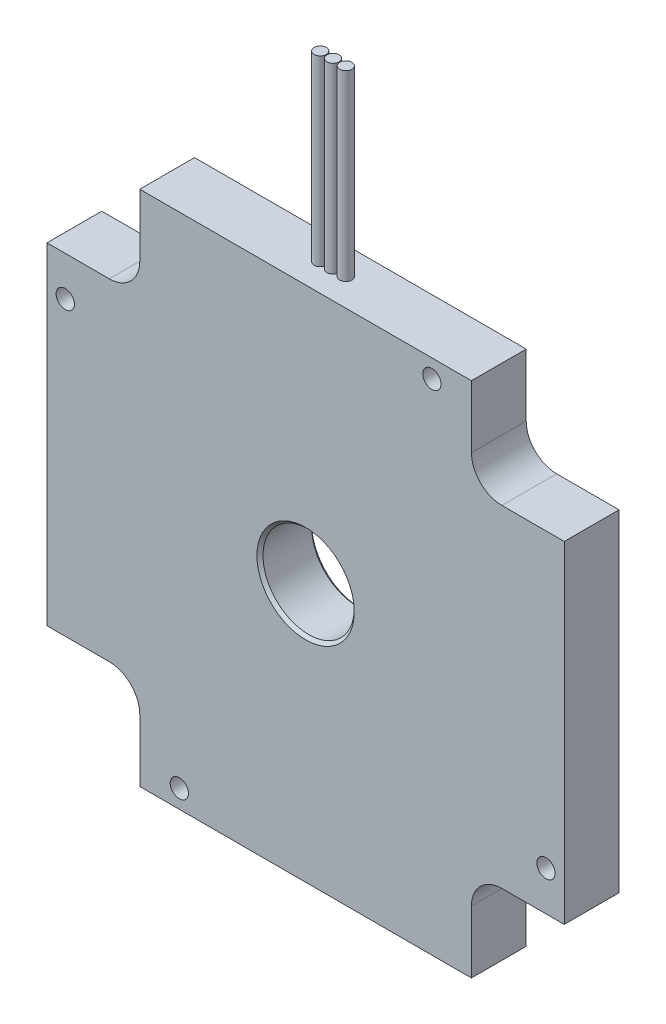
ISO-10303-21;
HEADER;
FILE_DESCRIPTION(('STEP AP214'),'2;1');
FILE_NAME('part.step','',(''),(''),'','','');
FILE_SCHEMA(('AUTOMOTIVE_DESIGN { 1 0 10303 214 1 1 1 1 }'));
ENDSEC;
DATA;
#1=APPLICATION_CONTEXT('core data for automotive mechanical design processes');
#2=APPLICATION_PROTOCOL_DEFINITION('international standard','automotive_design',2000,#1);
#3=PRODUCT_CONTEXT('',#1,'mechanical');
#4=PRODUCT('Part','Part','',(#3));
#5=PRODUCT_RELATED_PRODUCT_CATEGORY('part','',(#4));
#6=PRODUCT_DEFINITION_FORMATION('','',#4);
#7=PRODUCT_DEFINITION_CONTEXT('part definition',#1,'design');
#8=PRODUCT_DEFINITION('design','',#6,#7);
#9=PRODUCT_DEFINITION_SHAPE('','',#8);
#10=(LENGTH_UNIT() NAMED_UNIT(*) SI_UNIT(.MILLI.,.METRE.));
#11=(NAMED_UNIT(*) PLANE_ANGLE_UNIT() SI_UNIT($,.RADIAN.));
#12=(NAMED_UNIT(*) SI_UNIT($,.STERADIAN.) SOLID_ANGLE_UNIT());
#13=UNCERTAINTY_MEASURE_WITH_UNIT(LENGTH_MEASURE(1.E-05),#10,'distance_accuracy_value','');
#14=(GEOMETRIC_REPRESENTATION_CONTEXT(3) GLOBAL_UNCERTAINTY_ASSIGNED_CONTEXT((#13)) GLOBAL_UNIT_ASSIGNED_CONTEXT((#10,
#11,#12)) REPRESENTATION_CONTEXT('',''));
#15=CARTESIAN_POINT('',(0.,0.,0.));
#16=DIRECTION('',(0.,0.,1.));
#17=DIRECTION('',(1.,0.,0.));
#18=AXIS2_PLACEMENT_3D('',#15,#16,#17);
#19=CARTESIAN_POINT('',(27.25,42.5,9.));
#20=DIRECTION('',(0.,-1.,0.));
#21=DIRECTION('',(1.,0.,0.));
#22=AXIS2_PLACEMENT_3D('',#19,#20,#21);
#23=PLANE('',#22);
#24=CARTESIAN_POINT('',(-2.10000000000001,42.5,4.5));
#25=DIRECTION('',(0.,-1.,0.));
#26=DIRECTION('',(1.,0.,0.));
#27=AXIS2_PLACEMENT_3D('',#24,#25,#26);
#28=CIRCLE('',#27,1.);
#29=CARTESIAN_POINT('',(-1.10000000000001,42.5,4.5));
#30=VERTEX_POINT('',#29);
#31=EDGE_CURVE('E43',#30,#30,#28,.F.);
#32=ORIENTED_EDGE('',*,*,#31,.F.);
#33=EDGE_LOOP('',(#32));
#34=FACE_BOUND('',#33,.T.);
#35=DIRECTION('',(-1.,0.,0.));
#36=VECTOR('',#35,1.);
#37=CARTESIAN_POINT('',(27.25,42.5,0.));
#38=LINE('',#37,#36);
#39=CARTESIAN_POINT('',(27.25,42.5,0.));
#40=VERTEX_POINT('',#39);
#41=CARTESIAN_POINT('',(-27.25,42.5,0.));
#42=VERTEX_POINT('',#41);
#43=EDGE_CURVE('E238',#40,#42,#38,.T.);
#44=ORIENTED_EDGE('',*,*,#43,.T.);
#45=DIRECTION('',(0.,0.,-1.));
#46=VECTOR('',#45,1.);
#47=CARTESIAN_POINT('',(-27.25,42.5,9.));
#48=LINE('',#47,#46);
#49=CARTESIAN_POINT('',(-27.25,42.5,9.));
#50=VERTEX_POINT('',#49);
#51=EDGE_CURVE('E416',#50,#42,#48,.T.);
#52=ORIENTED_EDGE('',*,*,#51,.F.);
#53=DIRECTION('',(-1.,0.,0.));
#54=VECTOR('',#53,1.);
#55=CARTESIAN_POINT('',(27.25,42.5,9.));
#56=LINE('',#55,#54);
#57=CARTESIAN_POINT('',(27.25,42.5,9.));
#58=VERTEX_POINT('',#57);
#59=EDGE_CURVE('E419',#58,#50,#56,.T.);
#60=ORIENTED_EDGE('',*,*,#59,.F.);
#61=DIRECTION('',(0.,0.,-1.));
#62=VECTOR('',#61,1.);
#63=CARTESIAN_POINT('',(27.25,42.5,9.));
#64=LINE('',#63,#62);
#65=EDGE_CURVE('E180',#58,#40,#64,.T.);
#66=ORIENTED_EDGE('',*,*,#65,.T.);
#67=EDGE_LOOP('',(#44,#52,#60,#66));
#68=FACE_BOUND('',#67,.T.);
#69=CARTESIAN_POINT('',(0.,42.5,4.5));
#70=DIRECTION('',(0.,-1.,0.));
#71=DIRECTION('',(1.,0.,0.));
#72=AXIS2_PLACEMENT_3D('',#69,#70,#71);
#73=CIRCLE('',#72,1.);
#74=CARTESIAN_POINT('',(0.999999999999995,42.5,4.5));
#75=VERTEX_POINT('',#74);
#76=EDGE_CURVE('E224',#75,#75,#73,.F.);
#77=ORIENTED_EDGE('',*,*,#76,.F.);
#78=EDGE_LOOP('',(#77));
#79=FACE_BOUND('',#78,.T.);
#80=CARTESIAN_POINT('',(2.1,42.5,4.49999999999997));
#81=DIRECTION('',(0.,-1.,0.));
#82=DIRECTION('',(1.,0.,0.));
#83=AXIS2_PLACEMENT_3D('',#80,#81,#82);
#84=CIRCLE('',#83,1.);
#85=CARTESIAN_POINT('',(3.1,42.5,4.49999999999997));
#86=VERTEX_POINT('',#85);
#87=EDGE_CURVE('E11',#86,#86,#84,.F.);
#88=ORIENTED_EDGE('',*,*,#87,.F.);
#89=EDGE_LOOP('',(#88));
#90=FACE_BOUND('',#89,.T.);
#91=ADVANCED_FACE('F35',(#34,#68,#79,#90),#23,.F.);
#92=CARTESIAN_POINT('',(27.25,-27.25,9.));
#93=DIRECTION('',(0.,1.,0.));
#94=DIRECTION('',(-1.,0.,0.));
#95=AXIS2_PLACEMENT_3D('',#92,#93,#94);
#96=PLANE('',#95);
#97=DIRECTION('',(1.,0.,0.));
#98=VECTOR('',#97,1.);
#99=CARTESIAN_POINT('',(27.25,-27.25,9.));
#100=LINE('',#99,#98);
#101=CARTESIAN_POINT('',(32.25,-27.25,9.));
#102=VERTEX_POINT('',#101);
#103=CARTESIAN_POINT('',(42.5,-27.25,9.));
#104=VERTEX_POINT('',#103);
#105=EDGE_CURVE('E149',#102,#104,#100,.T.);
#106=ORIENTED_EDGE('',*,*,#105,.F.);
#107=DIRECTION('',(0.,0.,-1.));
#108=VECTOR('',#107,1.);
#109=CARTESIAN_POINT('',(32.25,-27.25,0.));
#110=LINE('',#109,#108);
#111=CARTESIAN_POINT('',(32.25,-27.25,0.));
#112=VERTEX_POINT('',#111);
#113=EDGE_CURVE('E207',#102,#112,#110,.T.);
#114=ORIENTED_EDGE('',*,*,#113,.T.);
#115=DIRECTION('',(1.,0.,0.));
#116=VECTOR('',#115,1.);
#117=CARTESIAN_POINT('',(27.25,-27.25,0.));
#118=LINE('',#117,#116);
#119=CARTESIAN_POINT('',(42.5,-27.25,0.));
#120=VERTEX_POINT('',#119);
#121=EDGE_CURVE('E173',#112,#120,#118,.T.);
#122=ORIENTED_EDGE('',*,*,#121,.T.);
#123=DIRECTION('',(0.,0.,-1.));
#124=VECTOR('',#123,1.);
#125=CARTESIAN_POINT('',(42.5,-27.25,9.));
#126=LINE('',#125,#124);
#127=EDGE_CURVE('E166',#104,#120,#126,.T.);
#128=ORIENTED_EDGE('',*,*,#127,.F.);
#129=EDGE_LOOP('',(#106,#114,#122,#128));
#130=FACE_BOUND('',#129,.T.);
#131=ADVANCED_FACE('F172',(#130),#96,.F.);
#132=CARTESIAN_POINT('',(42.5,27.25,9.));
#133=DIRECTION('',(-1.,0.,0.));
#134=DIRECTION('',(0.,-1.,0.));
#135=AXIS2_PLACEMENT_3D('',#132,#133,#134);
#136=PLANE('',#135);
#137=DIRECTION('',(0.,1.,0.));
#138=VECTOR('',#137,1.);
#139=CARTESIAN_POINT('',(42.5,27.25,0.));
#140=LINE('',#139,#138);
#141=CARTESIAN_POINT('',(42.5,27.25,0.));
#142=VERTEX_POINT('',#141);
#143=EDGE_CURVE('E383',#120,#142,#140,.T.);
#144=ORIENTED_EDGE('',*,*,#143,.T.);
#145=DIRECTION('',(0.,0.,-1.));
#146=VECTOR('',#145,1.);
#147=CARTESIAN_POINT('',(42.5,27.25,9.));
#148=LINE('',#147,#146);
#149=CARTESIAN_POINT('',(42.5,27.25,9.));
#150=VERTEX_POINT('',#149);
#151=EDGE_CURVE('E168',#150,#142,#148,.T.);
#152=ORIENTED_EDGE('',*,*,#151,.F.);
#153=DIRECTION('',(0.,1.,0.));
#154=VECTOR('',#153,1.);
#155=CARTESIAN_POINT('',(42.5,27.25,9.));
#156=LINE('',#155,#154);
#157=EDGE_CURVE('E153',#104,#150,#156,.T.);
#158=ORIENTED_EDGE('',*,*,#157,.F.);
#159=ORIENTED_EDGE('',*,*,#127,.T.);
#160=EDGE_LOOP('',(#144,#152,#158,#159));
#161=FACE_BOUND('',#160,.T.);
#162=ADVANCED_FACE('F165',(#161),#136,.F.);
#163=CARTESIAN_POINT('',(27.25,27.25,9.));
#164=DIRECTION('',(0.,-1.,0.));
#165=DIRECTION('',(0.,0.,-1.));
#166=AXIS2_PLACEMENT_3D('',#163,#164,#165);
#167=PLANE('',#166);
#168=DIRECTION('',(-1.,0.,0.));
#169=VECTOR('',#168,1.);
#170=CARTESIAN_POINT('',(27.25,27.25,0.));
#171=LINE('',#170,#169);
#172=CARTESIAN_POINT('',(32.25,27.25,0.));
#173=VERTEX_POINT('',#172);
#174=EDGE_CURVE('E386',#142,#173,#171,.T.);
#175=ORIENTED_EDGE('',*,*,#174,.T.);
#176=DIRECTION('',(0.,0.,-1.));
#177=VECTOR('',#176,1.);
#178=CARTESIAN_POINT('',(32.25,27.25,9.));
#179=LINE('',#178,#177);
#180=CARTESIAN_POINT('',(32.25,27.25,9.));
#181=VERTEX_POINT('',#180);
#182=EDGE_CURVE('E195',#173,#181,#179,.F.);
#183=ORIENTED_EDGE('',*,*,#182,.T.);
#184=DIRECTION('',(-1.,0.,0.));
#185=VECTOR('',#184,1.);
#186=CARTESIAN_POINT('',(27.25,27.25,9.));
#187=LINE('',#186,#185);
#188=EDGE_CURVE('E170',#150,#181,#187,.T.);
#189=ORIENTED_EDGE('',*,*,#188,.F.);
#190=ORIENTED_EDGE('',*,*,#151,.T.);
#191=EDGE_LOOP('',(#175,#183,#189,#190));
#192=FACE_BOUND('',#191,.T.);
#193=ADVANCED_FACE('F331',(#192),#167,.F.);
#194=CARTESIAN_POINT('',(27.25,27.25,9.));
#195=DIRECTION('',(-1.,0.,0.));
#196=DIRECTION('',(0.,-1.,0.));
#197=AXIS2_PLACEMENT_3D('',#194,#195,#196);
#198=PLANE('',#197);
#199=DIRECTION('',(0.,1.,0.));
#200=VECTOR('',#199,1.);
#201=CARTESIAN_POINT('',(27.25,27.25,9.));
#202=LINE('',#201,#200);
#203=CARTESIAN_POINT('',(27.25,32.25,9.));
#204=VERTEX_POINT('',#203);
#205=EDGE_CURVE('E438',#204,#58,#202,.T.);
#206=ORIENTED_EDGE('',*,*,#205,.F.);
#207=DIRECTION('',(0.,0.,-1.));
#208=VECTOR('',#207,1.);
#209=CARTESIAN_POINT('',(27.25,32.25,0.));
#210=LINE('',#209,#208);
#211=CARTESIAN_POINT('',(27.25,32.25,0.));
#212=VERTEX_POINT('',#211);
#213=EDGE_CURVE('E192',#204,#212,#210,.T.);
#214=ORIENTED_EDGE('',*,*,#213,.T.);
#215=DIRECTION('',(0.,1.,0.));
#216=VECTOR('',#215,1.);
#217=CARTESIAN_POINT('',(27.25,27.25,0.));
#218=LINE('',#217,#216);
#219=EDGE_CURVE('E389',#212,#40,#218,.T.);
#220=ORIENTED_EDGE('',*,*,#219,.T.);
#221=ORIENTED_EDGE('',*,*,#65,.F.);
#222=EDGE_LOOP('',(#206,#214,#220,#221));
#223=FACE_BOUND('',#222,.T.);
#224=ADVANCED_FACE('F326',(#223),#198,.F.);
#225=CARTESIAN_POINT('',(-27.25,27.25,9.));
#226=DIRECTION('',(1.,0.,0.));
#227=DIRECTION('',(0.,0.,-1.));
#228=AXIS2_PLACEMENT_3D('',#225,#226,#227);
#229=PLANE('',#228);
#230=DIRECTION('',(0.,-1.,0.));
#231=VECTOR('',#230,1.);
#232=CARTESIAN_POINT('',(-27.25,27.25,0.));
#233=LINE('',#232,#231);
#234=CARTESIAN_POINT('',(-27.25,32.25,0.));
#235=VERTEX_POINT('',#234);
#236=EDGE_CURVE('E392',#42,#235,#233,.T.);
#237=ORIENTED_EDGE('',*,*,#236,.T.);
#238=DIRECTION('',(0.,0.,-1.));
#239=VECTOR('',#238,1.);
#240=CARTESIAN_POINT('',(-27.25,32.25,9.));
#241=LINE('',#240,#239);
#242=CARTESIAN_POINT('',(-27.25,32.25,9.));
#243=VERTEX_POINT('',#242);
#244=EDGE_CURVE('E200',#235,#243,#241,.F.);
#245=ORIENTED_EDGE('',*,*,#244,.T.);
#246=DIRECTION('',(0.,-1.,0.));
#247=VECTOR('',#246,1.);
#248=CARTESIAN_POINT('',(-27.25,27.25,9.));
#249=LINE('',#248,#247);
#250=EDGE_CURVE('E432',#50,#243,#249,.T.);
#251=ORIENTED_EDGE('',*,*,#250,.F.);
#252=ORIENTED_EDGE('',*,*,#51,.T.);
#253=EDGE_LOOP('',(#237,#245,#251,#252));
#254=FACE_BOUND('',#253,.T.);
#255=ADVANCED_FACE('F323',(#254),#229,.F.);
#256=CARTESIAN_POINT('',(-42.5,27.25,9.));
#257=DIRECTION('',(0.,-1.,0.));
#258=DIRECTION('',(0.,0.,-1.));
#259=AXIS2_PLACEMENT_3D('',#256,#257,#258);
#260=PLANE('',#259);
#261=DIRECTION('',(-1.,0.,0.));
#262=VECTOR('',#261,1.);
#263=CARTESIAN_POINT('',(-42.5,27.25,9.));
#264=LINE('',#263,#262);
#265=CARTESIAN_POINT('',(-32.25,27.25,9.));
#266=VERTEX_POINT('',#265);
#267=CARTESIAN_POINT('',(-42.5,27.25,9.));
#268=VERTEX_POINT('',#267);
#269=EDGE_CURVE('E430',#266,#268,#264,.T.);
#270=ORIENTED_EDGE('',*,*,#269,.F.);
#271=DIRECTION('',(0.,0.,-1.));
#272=VECTOR('',#271,1.);
#273=CARTESIAN_POINT('',(-32.25,27.25,0.));
#274=LINE('',#273,#272);
#275=CARTESIAN_POINT('',(-32.25,27.25,0.));
#276=VERTEX_POINT('',#275);
#277=EDGE_CURVE('E197',#266,#276,#274,.T.);
#278=ORIENTED_EDGE('',*,*,#277,.T.);
#279=DIRECTION('',(-1.,0.,0.));
#280=VECTOR('',#279,1.);
#281=CARTESIAN_POINT('',(-42.5,27.25,0.));
#282=LINE('',#281,#280);
#283=CARTESIAN_POINT('',(-42.5,27.25,0.));
#284=VERTEX_POINT('',#283);
#285=EDGE_CURVE('E395',#276,#284,#282,.T.);
#286=ORIENTED_EDGE('',*,*,#285,.T.);
#287=DIRECTION('',(0.,0.,-1.));
#288=VECTOR('',#287,1.);
#289=CARTESIAN_POINT('',(-42.5,27.25,9.));
#290=LINE('',#289,#288);
#291=EDGE_CURVE('E413',#268,#284,#290,.T.);
#292=ORIENTED_EDGE('',*,*,#291,.F.);
#293=EDGE_LOOP('',(#270,#278,#286,#292));
#294=FACE_BOUND('',#293,.T.);
#295=ADVANCED_FACE('F319',(#294),#260,.F.);
#296=CARTESIAN_POINT('',(-42.5,27.25,9.));
#297=DIRECTION('',(1.,0.,0.));
#298=DIRECTION('',(0.,0.,-1.));
#299=AXIS2_PLACEMENT_3D('',#296,#297,#298);
#300=PLANE('',#299);
#301=DIRECTION('',(0.,-1.,0.));
#302=VECTOR('',#301,1.);
#303=CARTESIAN_POINT('',(-42.5,27.25,0.));
#304=LINE('',#303,#302);
#305=CARTESIAN_POINT('',(-42.5,-27.25,0.));
#306=VERTEX_POINT('',#305);
#307=EDGE_CURVE('E397',#284,#306,#304,.T.);
#308=ORIENTED_EDGE('',*,*,#307,.T.);
#309=DIRECTION('',(0.,0.,-1.));
#310=VECTOR('',#309,1.);
#311=CARTESIAN_POINT('',(-42.5,-27.25,9.));
#312=LINE('',#311,#310);
#313=CARTESIAN_POINT('',(-42.5,-27.25,9.));
#314=VERTEX_POINT('',#313);
#315=EDGE_CURVE('E410',#314,#306,#312,.T.);
#316=ORIENTED_EDGE('',*,*,#315,.F.);
#317=DIRECTION('',(0.,-1.,0.));
#318=VECTOR('',#317,1.);
#319=CARTESIAN_POINT('',(-42.5,27.25,9.));
#320=LINE('',#319,#318);
#321=EDGE_CURVE('E376',#268,#314,#320,.T.);
#322=ORIENTED_EDGE('',*,*,#321,.F.);
#323=ORIENTED_EDGE('',*,*,#291,.T.);
#324=EDGE_LOOP('',(#308,#316,#322,#323));
#325=FACE_BOUND('',#324,.T.);
#326=ADVANCED_FACE('F315',(#325),#300,.F.);
#327=CARTESIAN_POINT('',(-42.5,-27.25,9.));
#328=DIRECTION('',(0.,1.,0.));
#329=DIRECTION('',(0.,0.,1.));
#330=AXIS2_PLACEMENT_3D('',#327,#328,#329);
#331=PLANE('',#330);
#332=DIRECTION('',(1.,0.,0.));
#333=VECTOR('',#332,1.);
#334=CARTESIAN_POINT('',(-42.5,-27.25,0.));
#335=LINE('',#334,#333);
#336=CARTESIAN_POINT('',(-32.25,-27.25,0.));
#337=VERTEX_POINT('',#336);
#338=EDGE_CURVE('E399',#306,#337,#335,.T.);
#339=ORIENTED_EDGE('',*,*,#338,.T.);
#340=DIRECTION('',(0.,0.,-1.));
#341=VECTOR('',#340,1.);
#342=CARTESIAN_POINT('',(-32.25,-27.25,9.));
#343=LINE('',#342,#341);
#344=CARTESIAN_POINT('',(-32.25,-27.25,9.));
#345=VERTEX_POINT('',#344);
#346=EDGE_CURVE('E205',#337,#345,#343,.F.);
#347=ORIENTED_EDGE('',*,*,#346,.T.);
#348=DIRECTION('',(1.,0.,0.));
#349=VECTOR('',#348,1.);
#350=CARTESIAN_POINT('',(-42.5,-27.25,9.));
#351=LINE('',#350,#349);
#352=EDGE_CURVE('E367',#314,#345,#351,.T.);
#353=ORIENTED_EDGE('',*,*,#352,.F.);
#354=ORIENTED_EDGE('',*,*,#315,.T.);
#355=EDGE_LOOP('',(#339,#347,#353,#354));
#356=FACE_BOUND('',#355,.T.);
#357=ADVANCED_FACE('F311',(#356),#331,.F.);
#358=CARTESIAN_POINT('',(-27.25,-42.5,9.));
#359=DIRECTION('',(1.,0.,0.));
#360=DIRECTION('',(0.,0.,-1.));
#361=AXIS2_PLACEMENT_3D('',#358,#359,#360);
#362=PLANE('',#361);
#363=DIRECTION('',(0.,-1.,0.));
#364=VECTOR('',#363,1.);
#365=CARTESIAN_POINT('',(-27.25,-42.5,9.));
#366=LINE('',#365,#364);
#367=CARTESIAN_POINT('',(-27.25,-32.25,9.));
#368=VERTEX_POINT('',#367);
#369=CARTESIAN_POINT('',(-27.25,-42.5,9.));
#370=VERTEX_POINT('',#369);
#371=EDGE_CURVE('E364',#368,#370,#366,.T.);
#372=ORIENTED_EDGE('',*,*,#371,.F.);
#373=DIRECTION('',(0.,0.,-1.));
#374=VECTOR('',#373,1.);
#375=CARTESIAN_POINT('',(-27.25,-32.25,0.));
#376=LINE('',#375,#374);
#377=CARTESIAN_POINT('',(-27.25,-32.25,0.));
#378=VERTEX_POINT('',#377);
#379=EDGE_CURVE('E202',#368,#378,#376,.T.);
#380=ORIENTED_EDGE('',*,*,#379,.T.);
#381=DIRECTION('',(0.,-1.,0.));
#382=VECTOR('',#381,1.);
#383=CARTESIAN_POINT('',(-27.25,-42.5,0.));
#384=LINE('',#383,#382);
#385=CARTESIAN_POINT('',(-27.25,-42.5,0.));
#386=VERTEX_POINT('',#385);
#387=EDGE_CURVE('E402',#378,#386,#384,.T.);
#388=ORIENTED_EDGE('',*,*,#387,.T.);
#389=DIRECTION('',(0.,0.,-1.));
#390=VECTOR('',#389,1.);
#391=CARTESIAN_POINT('',(-27.25,-42.5,9.));
#392=LINE('',#391,#390);
#393=EDGE_CURVE('E370',#370,#386,#392,.T.);
#394=ORIENTED_EDGE('',*,*,#393,.F.);
#395=EDGE_LOOP('',(#372,#380,#388,#394));
#396=FACE_BOUND('',#395,.T.);
#397=ADVANCED_FACE('F307',(#396),#362,.F.);
#398=CARTESIAN_POINT('',(27.25,-42.5,9.));
#399=DIRECTION('',(0.,1.,0.));
#400=DIRECTION('',(-1.,0.,0.));
#401=AXIS2_PLACEMENT_3D('',#398,#399,#400);
#402=PLANE('',#401);
#403=DIRECTION('',(1.,0.,0.));
#404=VECTOR('',#403,1.);
#405=CARTESIAN_POINT('',(27.25,-42.5,0.));
#406=LINE('',#405,#404);
#407=CARTESIAN_POINT('',(27.25,-42.5,0.));
#408=VERTEX_POINT('',#407);
#409=EDGE_CURVE('E404',#386,#408,#406,.T.);
#410=ORIENTED_EDGE('',*,*,#409,.T.);
#411=DIRECTION('',(0.,0.,-1.));
#412=VECTOR('',#411,1.);
#413=CARTESIAN_POINT('',(27.25,-42.5,9.));
#414=LINE('',#413,#412);
#415=CARTESIAN_POINT('',(27.25,-42.5,9.));
#416=VERTEX_POINT('',#415);
#417=EDGE_CURVE('E381',#416,#408,#414,.T.);
#418=ORIENTED_EDGE('',*,*,#417,.F.);
#419=DIRECTION('',(1.,0.,0.));
#420=VECTOR('',#419,1.);
#421=CARTESIAN_POINT('',(27.25,-42.5,9.));
#422=LINE('',#421,#420);
#423=EDGE_CURVE('E372',#370,#416,#422,.T.);
#424=ORIENTED_EDGE('',*,*,#423,.F.);
#425=ORIENTED_EDGE('',*,*,#393,.T.);
#426=EDGE_LOOP('',(#410,#418,#424,#425));
#427=FACE_BOUND('',#426,.T.);
#428=ADVANCED_FACE('F304',(#427),#402,.F.);
#429=CARTESIAN_POINT('',(27.25,-42.5,9.));
#430=DIRECTION('',(-1.,0.,0.));
#431=DIRECTION('',(0.,0.,1.));
#432=AXIS2_PLACEMENT_3D('',#429,#430,#431);
#433=PLANE('',#432);
#434=DIRECTION('',(0.,1.,0.));
#435=VECTOR('',#434,1.);
#436=CARTESIAN_POINT('',(27.25,-42.5,0.));
#437=LINE('',#436,#435);
#438=CARTESIAN_POINT('',(27.25,-32.25,0.));
#439=VERTEX_POINT('',#438);
#440=EDGE_CURVE('E161',#408,#439,#437,.T.);
#441=ORIENTED_EDGE('',*,*,#440,.T.);
#442=DIRECTION('',(0.,0.,-1.));
#443=VECTOR('',#442,1.);
#444=CARTESIAN_POINT('',(27.25,-32.25,9.));
#445=LINE('',#444,#443);
#446=CARTESIAN_POINT('',(27.25,-32.25,9.));
#447=VERTEX_POINT('',#446);
#448=EDGE_CURVE('E50',#439,#447,#445,.F.);
#449=ORIENTED_EDGE('',*,*,#448,.T.);
#450=DIRECTION('',(0.,1.,0.));
#451=VECTOR('',#450,1.);
#452=CARTESIAN_POINT('',(27.25,-42.5,9.));
#453=LINE('',#452,#451);
#454=EDGE_CURVE('E374',#416,#447,#453,.T.);
#455=ORIENTED_EDGE('',*,*,#454,.F.);
#456=ORIENTED_EDGE('',*,*,#417,.T.);
#457=EDGE_LOOP('',(#441,#449,#455,#456));
#458=FACE_BOUND('',#457,.T.);
#459=ADVANCED_FACE('F297',(#458),#433,.F.);
#460=CARTESIAN_POINT('',(0.,0.,9.));
#461=DIRECTION('',(0.,0.,-1.));
#462=DIRECTION('',(-1.,0.,0.));
#463=AXIS2_PLACEMENT_3D('',#460,#461,#462);
#464=PLANE('',#463);
#465=CARTESIAN_POINT('',(20.75,39.5,9.));
#466=DIRECTION('',(0.,0.,1.));
#467=DIRECTION('',(1.,0.,0.));
#468=AXIS2_PLACEMENT_3D('',#465,#466,#467);
#469=CIRCLE('',#468,1.5);
#470=CARTESIAN_POINT('',(22.25,39.5,9.));
#471=VERTEX_POINT('',#470);
#472=EDGE_CURVE('E459',#471,#471,#469,.T.);
#473=ORIENTED_EDGE('',*,*,#472,.F.);
#474=EDGE_LOOP('',(#473));
#475=FACE_BOUND('',#474,.T.);
#476=CARTESIAN_POINT('',(39.5,-20.75,9.));
#477=DIRECTION('',(0.,0.,1.));
#478=DIRECTION('',(1.,0.,0.));
#479=AXIS2_PLACEMENT_3D('',#476,#477,#478);
#480=CIRCLE('',#479,1.5);
#481=CARTESIAN_POINT('',(41.,-20.75,9.));
#482=VERTEX_POINT('',#481);
#483=EDGE_CURVE('E453',#482,#482,#480,.T.);
#484=ORIENTED_EDGE('',*,*,#483,.F.);
#485=EDGE_LOOP('',(#484));
#486=FACE_BOUND('',#485,.T.);
#487=CARTESIAN_POINT('',(-20.75,-39.5,9.));
#488=DIRECTION('',(0.,0.,1.));
#489=DIRECTION('',(1.,0.,0.));
#490=AXIS2_PLACEMENT_3D('',#487,#488,#489);
#491=CIRCLE('',#490,1.5);
#492=CARTESIAN_POINT('',(-19.25,-39.5,9.));
#493=VERTEX_POINT('',#492);
#494=EDGE_CURVE('E447',#493,#493,#491,.T.);
#495=ORIENTED_EDGE('',*,*,#494,.F.);
#496=EDGE_LOOP('',(#495));
#497=FACE_BOUND('',#496,.T.);
#498=CARTESIAN_POINT('',(-39.4977479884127,20.75,9.));
#499=DIRECTION('',(0.,0.,1.));
#500=DIRECTION('',(1.,0.,0.));
#501=AXIS2_PLACEMENT_3D('',#498,#499,#500);
#502=CIRCLE('',#501,1.5);
#503=CARTESIAN_POINT('',(-37.9977479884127,20.75,9.));
#504=VERTEX_POINT('',#503);
#505=EDGE_CURVE('E441',#504,#504,#502,.T.);
#506=ORIENTED_EDGE('',*,*,#505,.F.);
#507=EDGE_LOOP('',(#506));
#508=FACE_BOUND('',#507,.T.);
#509=CARTESIAN_POINT('',(0.,0.,9.));
#510=DIRECTION('',(0.,0.,-1.));
#511=DIRECTION('',(-1.,0.,0.));
#512=AXIS2_PLACEMENT_3D('',#509,#510,#511);
#513=CIRCLE('',#512,8.00000000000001);
#514=CARTESIAN_POINT('',(-8.00000000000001,0.,9.));
#515=VERTEX_POINT('',#514);
#516=EDGE_CURVE('E189',#515,#515,#513,.T.);
#517=ORIENTED_EDGE('',*,*,#516,.T.);
#518=EDGE_LOOP('',(#517));
#519=FACE_BOUND('',#518,.T.);
#520=ORIENTED_EDGE('',*,*,#454,.T.);
#521=CARTESIAN_POINT('',(32.25,-32.25,9.));
#522=DIRECTION('',(0.,0.,-1.));
#523=DIRECTION('',(-1.,0.,0.));
#524=AXIS2_PLACEMENT_3D('',#521,#522,#523);
#525=CIRCLE('',#524,5.);
#526=EDGE_CURVE('E156',#447,#102,#525,.T.);
#527=ORIENTED_EDGE('',*,*,#526,.T.);
#528=ORIENTED_EDGE('',*,*,#105,.T.);
#529=ORIENTED_EDGE('',*,*,#157,.T.);
#530=ORIENTED_EDGE('',*,*,#188,.T.);
#531=CARTESIAN_POINT('',(32.25,32.25,9.));
#532=DIRECTION('',(0.,0.,-1.));
#533=DIRECTION('',(-1.,0.,0.));
#534=AXIS2_PLACEMENT_3D('',#531,#532,#533);
#535=CIRCLE('',#534,5.);
#536=EDGE_CURVE('E212',#181,#204,#535,.T.);
#537=ORIENTED_EDGE('',*,*,#536,.T.);
#538=ORIENTED_EDGE('',*,*,#205,.T.);
#539=ORIENTED_EDGE('',*,*,#59,.T.);
#540=ORIENTED_EDGE('',*,*,#250,.T.);
#541=CARTESIAN_POINT('',(-32.25,32.25,9.));
#542=DIRECTION('',(0.,0.,-1.));
#543=DIRECTION('',(-1.,0.,0.));
#544=AXIS2_PLACEMENT_3D('',#541,#542,#543);
#545=CIRCLE('',#544,5.);
#546=EDGE_CURVE('E216',#243,#266,#545,.T.);
#547=ORIENTED_EDGE('',*,*,#546,.T.);
#548=ORIENTED_EDGE('',*,*,#269,.T.);
#549=ORIENTED_EDGE('',*,*,#321,.T.);
#550=ORIENTED_EDGE('',*,*,#352,.T.);
#551=CARTESIAN_POINT('',(-32.25,-32.25,9.));
#552=DIRECTION('',(0.,0.,-1.));
#553=DIRECTION('',(-1.,0.,0.));
#554=AXIS2_PLACEMENT_3D('',#551,#552,#553);
#555=CIRCLE('',#554,5.);
#556=EDGE_CURVE('E220',#345,#368,#555,.T.);
#557=ORIENTED_EDGE('',*,*,#556,.T.);
#558=ORIENTED_EDGE('',*,*,#371,.T.);
#559=ORIENTED_EDGE('',*,*,#423,.T.);
#560=EDGE_LOOP('',(#520,#527,#528,#529,#530,#537,#538,#539,#540,#547,#548,#549,#550,#557,#558,#559));
#561=FACE_BOUND('',#560,.T.);
#562=ADVANCED_FACE('F151',(#475,#486,#497,#508,#519,#561),#464,.F.);
#563=CARTESIAN_POINT('',(0.,0.,0.));
#564=DIRECTION('',(0.,0.,-1.));
#565=DIRECTION('',(-1.,0.,0.));
#566=AXIS2_PLACEMENT_3D('',#563,#564,#565);
#567=PLANE('',#566);
#568=CARTESIAN_POINT('',(20.75,39.5,0.));
#569=DIRECTION('',(0.,0.,1.));
#570=DIRECTION('',(1.,0.,0.));
#571=AXIS2_PLACEMENT_3D('',#568,#569,#570);
#572=CIRCLE('',#571,1.5);
#573=CARTESIAN_POINT('',(22.25,39.5,0.));
#574=VERTEX_POINT('',#573);
#575=EDGE_CURVE('E456',#574,#574,#572,.T.);
#576=ORIENTED_EDGE('',*,*,#575,.T.);
#577=EDGE_LOOP('',(#576));
#578=FACE_BOUND('',#577,.T.);
#579=CARTESIAN_POINT('',(39.5,-20.75,0.));
#580=DIRECTION('',(0.,0.,1.));
#581=DIRECTION('',(1.,0.,0.));
#582=AXIS2_PLACEMENT_3D('',#579,#580,#581);
#583=CIRCLE('',#582,1.5);
#584=CARTESIAN_POINT('',(41.,-20.75,0.));
#585=VERTEX_POINT('',#584);
#586=EDGE_CURVE('E450',#585,#585,#583,.T.);
#587=ORIENTED_EDGE('',*,*,#586,.T.);
#588=EDGE_LOOP('',(#587));
#589=FACE_BOUND('',#588,.T.);
#590=CARTESIAN_POINT('',(-20.75,-39.5,0.));
#591=DIRECTION('',(0.,0.,1.));
#592=DIRECTION('',(1.,0.,0.));
#593=AXIS2_PLACEMENT_3D('',#590,#591,#592);
#594=CIRCLE('',#593,1.5);
#595=CARTESIAN_POINT('',(-19.25,-39.5,0.));
#596=VERTEX_POINT('',#595);
#597=EDGE_CURVE('E444',#596,#596,#594,.T.);
#598=ORIENTED_EDGE('',*,*,#597,.T.);
#599=EDGE_LOOP('',(#598));
#600=FACE_BOUND('',#599,.T.);
#601=CARTESIAN_POINT('',(-39.4977479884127,20.75,0.));
#602=DIRECTION('',(0.,0.,1.));
#603=DIRECTION('',(1.,0.,0.));
#604=AXIS2_PLACEMENT_3D('',#601,#602,#603);
#605=CIRCLE('',#604,1.5);
#606=CARTESIAN_POINT('',(-37.9977479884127,20.75,0.));
#607=VERTEX_POINT('',#606);
#608=EDGE_CURVE('E384',#607,#607,#605,.T.);
#609=ORIENTED_EDGE('',*,*,#608,.T.);
#610=EDGE_LOOP('',(#609));
#611=FACE_BOUND('',#610,.T.);
#612=CARTESIAN_POINT('',(0.,0.,0.));
#613=DIRECTION('',(0.,0.,-1.));
#614=DIRECTION('',(-1.,0.,0.));
#615=AXIS2_PLACEMENT_3D('',#612,#613,#614);
#616=CIRCLE('',#615,7.99999999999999);
#617=CARTESIAN_POINT('',(-7.99999999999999,0.,0.));
#618=VERTEX_POINT('',#617);
#619=EDGE_CURVE('E175',#618,#618,#616,.F.);
#620=ORIENTED_EDGE('',*,*,#619,.T.);
#621=EDGE_LOOP('',(#620));
#622=FACE_BOUND('',#621,.T.);
#623=ORIENTED_EDGE('',*,*,#121,.F.);
#624=CARTESIAN_POINT('',(32.25,-32.25,0.));
#625=DIRECTION('',(0.,0.,-1.));
#626=DIRECTION('',(-1.,0.,0.));
#627=AXIS2_PLACEMENT_3D('',#624,#625,#626);
#628=CIRCLE('',#627,5.);
#629=EDGE_CURVE('E58',#112,#439,#628,.F.);
#630=ORIENTED_EDGE('',*,*,#629,.T.);
#631=ORIENTED_EDGE('',*,*,#440,.F.);
#632=ORIENTED_EDGE('',*,*,#409,.F.);
#633=ORIENTED_EDGE('',*,*,#387,.F.);
#634=CARTESIAN_POINT('',(-32.25,-32.25,0.));
#635=DIRECTION('',(0.,0.,-1.));
#636=DIRECTION('',(-1.,0.,0.));
#637=AXIS2_PLACEMENT_3D('',#634,#635,#636);
#638=CIRCLE('',#637,5.);
#639=EDGE_CURVE('E218',#378,#337,#638,.F.);
#640=ORIENTED_EDGE('',*,*,#639,.T.);
#641=ORIENTED_EDGE('',*,*,#338,.F.);
#642=ORIENTED_EDGE('',*,*,#307,.F.);
#643=ORIENTED_EDGE('',*,*,#285,.F.);
#644=CARTESIAN_POINT('',(-32.25,32.25,0.));
#645=DIRECTION('',(0.,0.,-1.));
#646=DIRECTION('',(-1.,0.,0.));
#647=AXIS2_PLACEMENT_3D('',#644,#645,#646);
#648=CIRCLE('',#647,5.);
#649=EDGE_CURVE('E214',#276,#235,#648,.F.);
#650=ORIENTED_EDGE('',*,*,#649,.T.);
#651=ORIENTED_EDGE('',*,*,#236,.F.);
#652=ORIENTED_EDGE('',*,*,#43,.F.);
#653=ORIENTED_EDGE('',*,*,#219,.F.);
#654=CARTESIAN_POINT('',(32.25,32.25,0.));
#655=DIRECTION('',(0.,0.,-1.));
#656=DIRECTION('',(-1.,0.,0.));
#657=AXIS2_PLACEMENT_3D('',#654,#655,#656);
#658=CIRCLE('',#657,5.);
#659=EDGE_CURVE('E210',#212,#173,#658,.F.);
#660=ORIENTED_EDGE('',*,*,#659,.T.);
#661=ORIENTED_EDGE('',*,*,#174,.F.);
#662=ORIENTED_EDGE('',*,*,#143,.F.);
#663=EDGE_LOOP('',(#623,#630,#631,#632,#633,#640,#641,#642,#643,#650,#651,#652,#653,#660,#661,#662));
#664=FACE_BOUND('',#663,.T.);
#665=ADVANCED_FACE('F293',(#578,#589,#600,#611,#622,#664),#567,.T.);
#666=CARTESIAN_POINT('',(0.,0.,0.));
#667=DIRECTION('',(0.,0.,1.));
#668=DIRECTION('',(1.,0.,0.));
#669=AXIS2_PLACEMENT_3D('',#666,#667,#668);
#670=CYLINDRICAL_SURFACE('',#669,7.5);
#671=CARTESIAN_POINT('',(0.,0.,0.500000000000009));
#672=DIRECTION('',(0.,0.,-1.));
#673=DIRECTION('',(-1.,0.,0.));
#674=AXIS2_PLACEMENT_3D('',#671,#672,#673);
#675=CIRCLE('',#674,7.5);
#676=CARTESIAN_POINT('',(-7.5,0.,0.500000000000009));
#677=VERTEX_POINT('',#676);
#678=EDGE_CURVE('E186',#677,#677,#675,.T.);
#679=ORIENTED_EDGE('',*,*,#678,.T.);
#680=EDGE_LOOP('',(#679));
#681=FACE_BOUND('',#680,.T.);
#682=CARTESIAN_POINT('',(0.,0.,8.50000000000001));
#683=DIRECTION('',(0.,0.,-1.));
#684=DIRECTION('',(-1.,0.,0.));
#685=AXIS2_PLACEMENT_3D('',#682,#683,#684);
#686=CIRCLE('',#685,7.5);
#687=CARTESIAN_POINT('',(-7.5,0.,8.50000000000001));
#688=VERTEX_POINT('',#687);
#689=EDGE_CURVE('E178',#688,#688,#686,.F.);
#690=ORIENTED_EDGE('',*,*,#689,.T.);
#691=EDGE_LOOP('',(#690));
#692=FACE_BOUND('',#691,.T.);
#693=ADVANCED_FACE('F289',(#681,#692),#670,.F.);
#694=CARTESIAN_POINT('',(0.,0.,0.));
#695=DIRECTION('',(0.,0.,-1.));
#696=DIRECTION('',(-1.,0.,0.));
#697=AXIS2_PLACEMENT_3D('',#694,#695,#696);
#698=CONICAL_SURFACE('',#697,7.99999999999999,0.785398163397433);
#699=ORIENTED_EDGE('',*,*,#678,.F.);
#700=EDGE_LOOP('',(#699));
#701=FACE_BOUND('',#700,.T.);
#702=ORIENTED_EDGE('',*,*,#619,.F.);
#703=EDGE_LOOP('',(#702));
#704=FACE_BOUND('',#703,.T.);
#705=ADVANCED_FACE('F292',(#701,#704),#698,.F.);
#706=CARTESIAN_POINT('',(0.,0.,8.50000000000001));
#707=DIRECTION('',(0.,0.,1.));
#708=DIRECTION('',(1.,0.,0.));
#709=AXIS2_PLACEMENT_3D('',#706,#707,#708);
#710=CONICAL_SURFACE('',#709,7.5,0.785398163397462);
#711=ORIENTED_EDGE('',*,*,#516,.F.);
#712=EDGE_LOOP('',(#711));
#713=FACE_BOUND('',#712,.T.);
#714=ORIENTED_EDGE('',*,*,#689,.F.);
#715=EDGE_LOOP('',(#714));
#716=FACE_BOUND('',#715,.T.);
#717=ADVANCED_FACE('F287',(#713,#716),#710,.F.);
#718=CARTESIAN_POINT('',(-39.4977479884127,20.75,0.));
#719=DIRECTION('',(0.,0.,1.));
#720=DIRECTION('',(1.,0.,0.));
#721=AXIS2_PLACEMENT_3D('',#718,#719,#720);
#722=CYLINDRICAL_SURFACE('',#721,1.5);
#723=ORIENTED_EDGE('',*,*,#608,.F.);
#724=EDGE_LOOP('',(#723));
#725=FACE_BOUND('',#724,.T.);
#726=ORIENTED_EDGE('',*,*,#505,.T.);
#727=EDGE_LOOP('',(#726));
#728=FACE_BOUND('',#727,.T.);
#729=ADVANCED_FACE('F283',(#725,#728),#722,.F.);
#730=CARTESIAN_POINT('',(-20.75,-39.5,0.));
#731=DIRECTION('',(0.,0.,1.));
#732=DIRECTION('',(1.,0.,0.));
#733=AXIS2_PLACEMENT_3D('',#730,#731,#732);
#734=CYLINDRICAL_SURFACE('',#733,1.5);
#735=ORIENTED_EDGE('',*,*,#597,.F.);
#736=EDGE_LOOP('',(#735));
#737=FACE_BOUND('',#736,.T.);
#738=ORIENTED_EDGE('',*,*,#494,.T.);
#739=EDGE_LOOP('',(#738));
#740=FACE_BOUND('',#739,.T.);
#741=ADVANCED_FACE('F279',(#737,#740),#734,.F.);
#742=CARTESIAN_POINT('',(39.5,-20.75,0.));
#743=DIRECTION('',(0.,0.,1.));
#744=DIRECTION('',(1.,0.,0.));
#745=AXIS2_PLACEMENT_3D('',#742,#743,#744);
#746=CYLINDRICAL_SURFACE('',#745,1.5);
#747=ORIENTED_EDGE('',*,*,#586,.F.);
#748=EDGE_LOOP('',(#747));
#749=FACE_BOUND('',#748,.T.);
#750=ORIENTED_EDGE('',*,*,#483,.T.);
#751=EDGE_LOOP('',(#750));
#752=FACE_BOUND('',#751,.T.);
#753=ADVANCED_FACE('F275',(#749,#752),#746,.F.);
#754=CARTESIAN_POINT('',(20.75,39.5,0.));
#755=DIRECTION('',(0.,0.,1.));
#756=DIRECTION('',(1.,0.,0.));
#757=AXIS2_PLACEMENT_3D('',#754,#755,#756);
#758=CYLINDRICAL_SURFACE('',#757,1.5);
#759=ORIENTED_EDGE('',*,*,#575,.F.);
#760=EDGE_LOOP('',(#759));
#761=FACE_BOUND('',#760,.T.);
#762=ORIENTED_EDGE('',*,*,#472,.T.);
#763=EDGE_LOOP('',(#762));
#764=FACE_BOUND('',#763,.T.);
#765=ADVANCED_FACE('F271',(#761,#764),#758,.F.);
#766=CARTESIAN_POINT('',(32.25,32.25,9.));
#767=DIRECTION('',(0.,0.,1.));
#768=DIRECTION('',(1.,0.,0.));
#769=AXIS2_PLACEMENT_3D('',#766,#767,#768);
#770=CYLINDRICAL_SURFACE('',#769,5.);
#771=ORIENTED_EDGE('',*,*,#536,.F.);
#772=ORIENTED_EDGE('',*,*,#182,.F.);
#773=ORIENTED_EDGE('',*,*,#659,.F.);
#774=ORIENTED_EDGE('',*,*,#213,.F.);
#775=EDGE_LOOP('',(#771,#772,#773,#774));
#776=FACE_BOUND('',#775,.T.);
#777=ADVANCED_FACE('F274',(#776),#770,.F.);
#778=CARTESIAN_POINT('',(-32.25,32.25,9.));
#779=DIRECTION('',(0.,0.,1.));
#780=DIRECTION('',(1.,0.,0.));
#781=AXIS2_PLACEMENT_3D('',#778,#779,#780);
#782=CYLINDRICAL_SURFACE('',#781,5.);
#783=ORIENTED_EDGE('',*,*,#546,.F.);
#784=ORIENTED_EDGE('',*,*,#244,.F.);
#785=ORIENTED_EDGE('',*,*,#649,.F.);
#786=ORIENTED_EDGE('',*,*,#277,.F.);
#787=EDGE_LOOP('',(#783,#784,#785,#786));
#788=FACE_BOUND('',#787,.T.);
#789=ADVANCED_FACE('F348',(#788),#782,.F.);
#790=CARTESIAN_POINT('',(-32.25,-32.25,9.));
#791=DIRECTION('',(0.,0.,1.));
#792=DIRECTION('',(1.,0.,0.));
#793=AXIS2_PLACEMENT_3D('',#790,#791,#792);
#794=CYLINDRICAL_SURFACE('',#793,5.);
#795=ORIENTED_EDGE('',*,*,#556,.F.);
#796=ORIENTED_EDGE('',*,*,#346,.F.);
#797=ORIENTED_EDGE('',*,*,#639,.F.);
#798=ORIENTED_EDGE('',*,*,#379,.F.);
#799=EDGE_LOOP('',(#795,#796,#797,#798));
#800=FACE_BOUND('',#799,.T.);
#801=ADVANCED_FACE('F351',(#800),#794,.F.);
#802=CARTESIAN_POINT('',(32.25,-32.25,9.));
#803=DIRECTION('',(0.,0.,1.));
#804=DIRECTION('',(1.,0.,0.));
#805=AXIS2_PLACEMENT_3D('',#802,#803,#804);
#806=CYLINDRICAL_SURFACE('',#805,5.);
#807=ORIENTED_EDGE('',*,*,#526,.F.);
#808=ORIENTED_EDGE('',*,*,#448,.F.);
#809=ORIENTED_EDGE('',*,*,#629,.F.);
#810=ORIENTED_EDGE('',*,*,#113,.F.);
#811=EDGE_LOOP('',(#807,#808,#809,#810));
#812=FACE_BOUND('',#811,.T.);
#813=ADVANCED_FACE('F37',(#812),#806,.F.);
#814=CARTESIAN_POINT('',(0.,72.5,4.5));
#815=DIRECTION('',(0.,-1.,0.));
#816=DIRECTION('',(1.,0.,0.));
#817=AXIS2_PLACEMENT_3D('',#814,#815,#816);
#818=CYLINDRICAL_SURFACE('',#817,1.);
#819=CARTESIAN_POINT('',(0.,72.5,4.5));
#820=DIRECTION('',(0.,1.,0.));
#821=DIRECTION('',(-1.,0.,0.));
#822=AXIS2_PLACEMENT_3D('',#819,#820,#821);
#823=CIRCLE('',#822,1.);
#824=CARTESIAN_POINT('',(-1.00000000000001,72.5,4.5));
#825=VERTEX_POINT('',#824);
#826=EDGE_CURVE('E462',#825,#825,#823,.T.);
#827=ORIENTED_EDGE('',*,*,#826,.F.);
#828=EDGE_LOOP('',(#827));
#829=FACE_BOUND('',#828,.T.);
#830=ORIENTED_EDGE('',*,*,#76,.T.);
#831=EDGE_LOOP('',(#830));
#832=FACE_BOUND('',#831,.T.);
#833=ADVANCED_FACE('F266',(#829,#832),#818,.T.);
#834=CARTESIAN_POINT('',(0.,72.5,4.5));
#835=DIRECTION('',(0.,1.,0.));
#836=DIRECTION('',(-1.,0.,0.));
#837=AXIS2_PLACEMENT_3D('',#834,#835,#836);
#838=PLANE('',#837);
#839=ORIENTED_EDGE('',*,*,#826,.T.);
#840=EDGE_LOOP('',(#839));
#841=FACE_BOUND('',#840,.T.);
#842=ADVANCED_FACE('F262',(#841),#838,.T.);
#843=CARTESIAN_POINT('',(-2.10000000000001,72.5,4.5));
#844=DIRECTION('',(0.,-1.,0.));
#845=DIRECTION('',(1.,0.,0.));
#846=AXIS2_PLACEMENT_3D('',#843,#844,#845);
#847=CYLINDRICAL_SURFACE('',#846,1.);
#848=CARTESIAN_POINT('',(-2.10000000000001,72.5,4.5));
#849=DIRECTION('',(0.,1.,0.));
#850=DIRECTION('',(-1.,0.,0.));
#851=AXIS2_PLACEMENT_3D('',#848,#849,#850);
#852=CIRCLE('',#851,1.);
#853=CARTESIAN_POINT('',(-3.10000000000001,72.5,4.5));
#854=VERTEX_POINT('',#853);
#855=EDGE_CURVE('E467',#854,#854,#852,.T.);
#856=ORIENTED_EDGE('',*,*,#855,.F.);
#857=EDGE_LOOP('',(#856));
#858=FACE_BOUND('',#857,.T.);
#859=ORIENTED_EDGE('',*,*,#31,.T.);
#860=EDGE_LOOP('',(#859));
#861=FACE_BOUND('',#860,.T.);
#862=ADVANCED_FACE('F229',(#858,#861),#847,.T.);
#863=CARTESIAN_POINT('',(-2.10000000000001,72.5,4.5));
#864=DIRECTION('',(0.,1.,0.));
#865=DIRECTION('',(-1.,0.,0.));
#866=AXIS2_PLACEMENT_3D('',#863,#864,#865);
#867=PLANE('',#866);
#868=ORIENTED_EDGE('',*,*,#855,.T.);
#869=EDGE_LOOP('',(#868));
#870=FACE_BOUND('',#869,.T.);
#871=ADVANCED_FACE('F247',(#870),#867,.T.);
#872=CARTESIAN_POINT('',(2.09999999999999,72.5,4.49999999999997));
#873=DIRECTION('',(0.,-1.,0.));
#874=DIRECTION('',(1.,0.,0.));
#875=AXIS2_PLACEMENT_3D('',#872,#873,#874);
#876=CYLINDRICAL_SURFACE('',#875,1.);
#877=CARTESIAN_POINT('',(2.09999999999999,72.5,4.49999999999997));
#878=DIRECTION('',(0.,1.,0.));
#879=DIRECTION('',(-1.,0.,0.));
#880=AXIS2_PLACEMENT_3D('',#877,#878,#879);
#881=CIRCLE('',#880,1.);
#882=CARTESIAN_POINT('',(1.09999999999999,72.5,4.49999999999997));
#883=VERTEX_POINT('',#882);
#884=EDGE_CURVE('E470',#883,#883,#881,.T.);
#885=ORIENTED_EDGE('',*,*,#884,.F.);
#886=EDGE_LOOP('',(#885));
#887=FACE_BOUND('',#886,.T.);
#888=ORIENTED_EDGE('',*,*,#87,.T.);
#889=EDGE_LOOP('',(#888));
#890=FACE_BOUND('',#889,.T.);
#891=ADVANCED_FACE('F244',(#887,#890),#876,.T.);
#892=CARTESIAN_POINT('',(2.09999999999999,72.5,4.49999999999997));
#893=DIRECTION('',(0.,1.,0.));
#894=DIRECTION('',(-1.,0.,0.));
#895=AXIS2_PLACEMENT_3D('',#892,#893,#894);
#896=PLANE('',#895);
#897=ORIENTED_EDGE('',*,*,#884,.T.);
#898=EDGE_LOOP('',(#897));
#899=FACE_BOUND('',#898,.T.);
#900=ADVANCED_FACE('F246',(#899),#896,.T.);
#901=CLOSED_SHELL('',(#91,#131,#162,#193,#224,#255,#295,#326,#357,#397,#428,#459,#562,#665,#693,
#705,#717,#729,#741,#753,#765,#777,#789,#801,#813,#833,#842,#862,#871,#891,#900));
#902=MANIFOLD_SOLID_BREP('B2',#901);
#903=ADVANCED_BREP_SHAPE_REPRESENTATION('',(#18,#902),#14);
#904=SHAPE_DEFINITION_REPRESENTATION(#9,#903);
ENDSEC;
END-ISO-10303-21;
